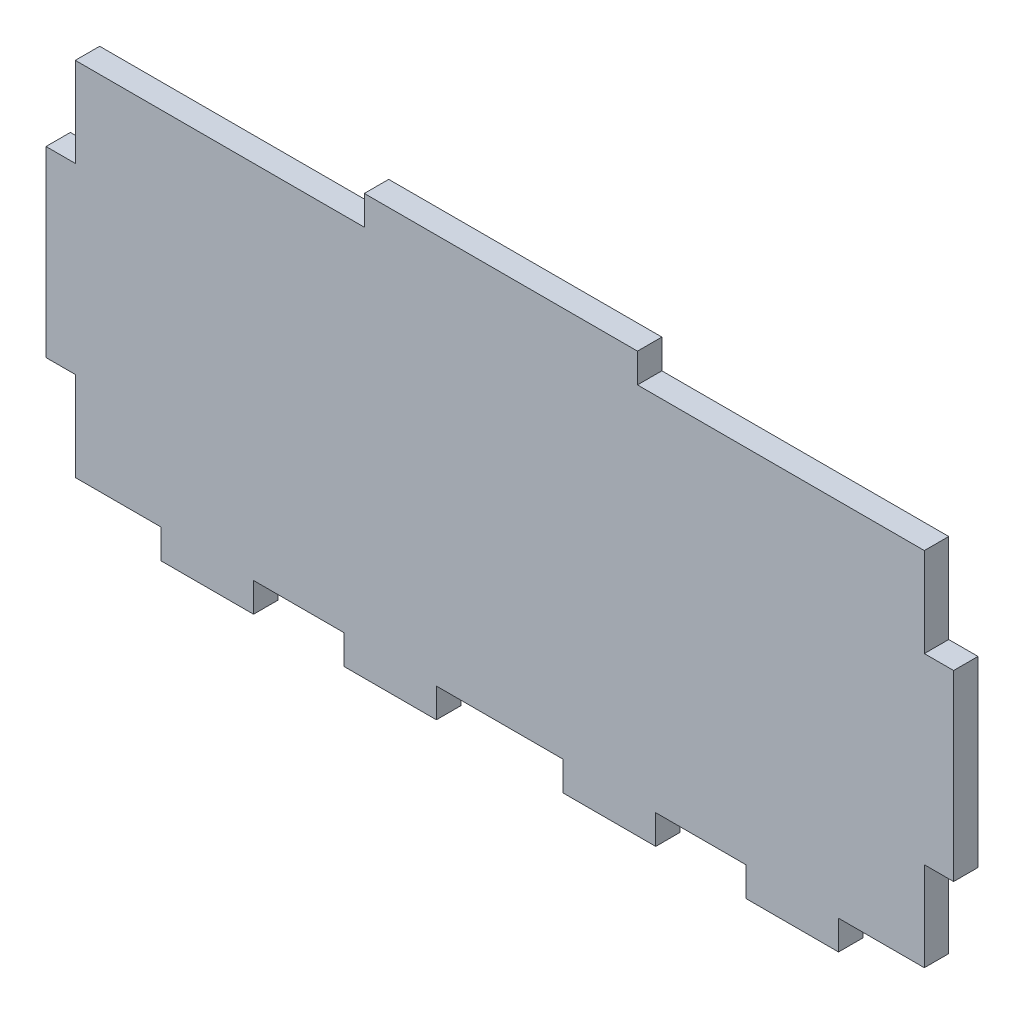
from build123d import *

# Parameters (mm, degrees)
BOSS_EXTRUDE1_DEPTH = 2.7


with BuildPart() as part:
    # Sketch1 → Boss-Extrude1 (new body)
    with BuildSketch(Plane.XY):
        Polygon((47, -20), (37.5, -20), (37.5, -23.24), (27.26, -23.24), (27.26, -20), (17.26, -20), (17.26, -23.24), (7.02, -23.24), (7.02, -20), (-7.02, -20), (-7.02, -23.24), (-17.26, -23.24), (-17.26, -20), (-27.26, -20), (-27.26, -23.24), (-37.5, -23.24), (-37.5, -20), (-47, -20), (-47, -10.12), (-50.24, -10.12), (-50.24, 10.12), (-47, 10.12), (-47, 20), (-15, 20), (-15, 23.24), (15.24, 23.24), (15.24, 20), (47, 20), (47, 10.12), (50.24, 10.12), (50.24, -10.12), (47, -10.12), align=None)
    extrude(amount=BOSS_EXTRUDE1_DEPTH)


solid = part.part
